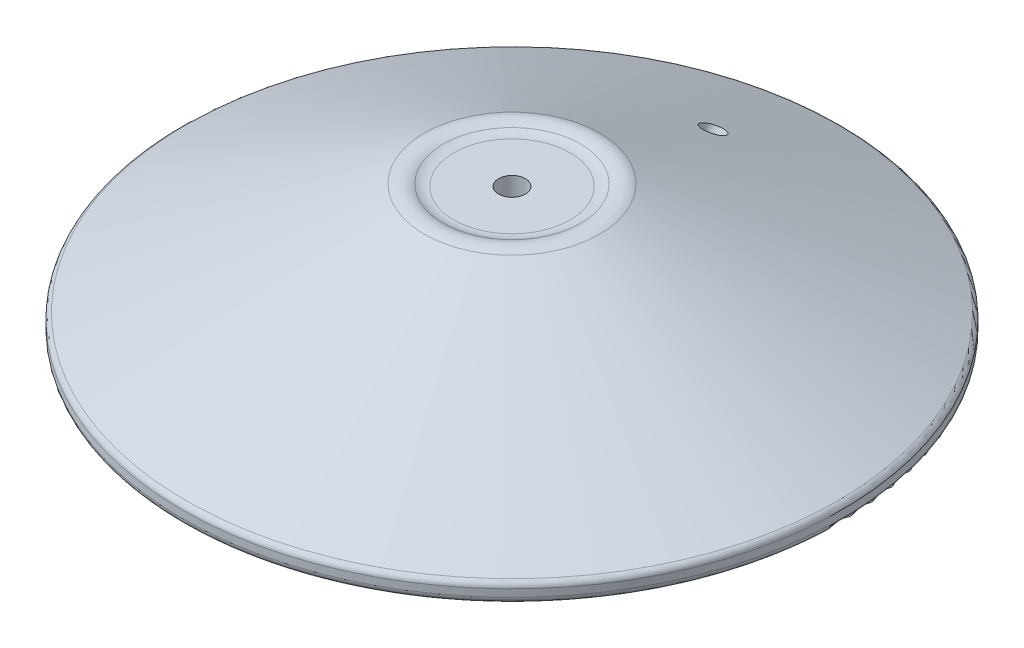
ISO-10303-21;
HEADER;
FILE_DESCRIPTION(('STEP AP214'),'2;1');
FILE_NAME('part.step','',(''),(''),'','','');
FILE_SCHEMA(('AUTOMOTIVE_DESIGN { 1 0 10303 214 1 1 1 1 }'));
ENDSEC;
DATA;
#1=APPLICATION_CONTEXT('core data for automotive mechanical design processes');
#2=APPLICATION_PROTOCOL_DEFINITION('international standard','automotive_design',2000,#1);
#3=PRODUCT_CONTEXT('',#1,'mechanical');
#4=PRODUCT('Part','Part','',(#3));
#5=PRODUCT_RELATED_PRODUCT_CATEGORY('part','',(#4));
#6=PRODUCT_DEFINITION_FORMATION('','',#4);
#7=PRODUCT_DEFINITION_CONTEXT('part definition',#1,'design');
#8=PRODUCT_DEFINITION('design','',#6,#7);
#9=PRODUCT_DEFINITION_SHAPE('','',#8);
#10=(LENGTH_UNIT() NAMED_UNIT(*) SI_UNIT(.MILLI.,.METRE.));
#11=(NAMED_UNIT(*) PLANE_ANGLE_UNIT() SI_UNIT($,.RADIAN.));
#12=(NAMED_UNIT(*) SI_UNIT($,.STERADIAN.) SOLID_ANGLE_UNIT());
#13=UNCERTAINTY_MEASURE_WITH_UNIT(LENGTH_MEASURE(1.E-05),#10,'distance_accuracy_value','');
#14=(GEOMETRIC_REPRESENTATION_CONTEXT(3) GLOBAL_UNCERTAINTY_ASSIGNED_CONTEXT((#13)) GLOBAL_UNIT_ASSIGNED_CONTEXT((#10,
#11,#12)) REPRESENTATION_CONTEXT('',''));
#15=CARTESIAN_POINT('',(0.,0.,0.));
#16=DIRECTION('',(0.,0.,1.));
#17=DIRECTION('',(1.,0.,0.));
#18=AXIS2_PLACEMENT_3D('',#15,#16,#17);
#19=CARTESIAN_POINT('',(0.,0.,0.));
#20=DIRECTION('',(0.,-1.,0.));
#21=DIRECTION('',(0.,0.,-1.));
#22=AXIS2_PLACEMENT_3D('',#19,#20,#21);
#23=CYLINDRICAL_SURFACE('',#22,6.);
#24=CARTESIAN_POINT('',(0.,3.00000000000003,0.));
#25=DIRECTION('',(0.,-1.,0.));
#26=DIRECTION('',(0.,0.,-1.));
#27=AXIS2_PLACEMENT_3D('',#24,#25,#26);
#28=CIRCLE('',#27,6.);
#29=CARTESIAN_POINT('',(0.,3.00000000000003,-6.));
#30=VERTEX_POINT('',#29);
#31=EDGE_CURVE('E49',#30,#30,#28,.T.);
#32=ORIENTED_EDGE('',*,*,#31,.T.);
#33=EDGE_LOOP('',(#32));
#34=FACE_BOUND('',#33,.T.);
#35=CARTESIAN_POINT('',(0.,58.,0.));
#36=DIRECTION('',(0.,-1.,0.));
#37=DIRECTION('',(0.,0.,-1.));
#38=AXIS2_PLACEMENT_3D('',#35,#36,#37);
#39=CIRCLE('',#38,6.);
#40=CARTESIAN_POINT('',(0.,58.,-6.));
#41=VERTEX_POINT('',#40);
#42=EDGE_CURVE('E62',#41,#41,#39,.T.);
#43=ORIENTED_EDGE('',*,*,#42,.F.);
#44=EDGE_LOOP('',(#43));
#45=FACE_BOUND('',#44,.T.);
#46=ADVANCED_FACE('F41',(#34,#45),#23,.F.);
#47=CARTESIAN_POINT('',(6.00000000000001,0.,0.));
#48=DIRECTION('',(0.,-1.,0.));
#49=DIRECTION('',(0.,0.,-1.));
#50=AXIS2_PLACEMENT_3D('',#47,#48,#49);
#51=PLANE('',#50);
#52=CARTESIAN_POINT('',(0.,0.,0.));
#53=DIRECTION('',(0.,-1.,0.));
#54=DIRECTION('',(0.,0.,-1.));
#55=AXIS2_PLACEMENT_3D('',#52,#53,#54);
#56=CIRCLE('',#55,9.00000000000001);
#57=CARTESIAN_POINT('',(0.,0.,-9.00000000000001));
#58=VERTEX_POINT('',#57);
#59=EDGE_CURVE('E11',#58,#58,#56,.F.);
#60=ORIENTED_EDGE('',*,*,#59,.T.);
#61=EDGE_LOOP('',(#60));
#62=FACE_BOUND('',#61,.T.);
#63=CARTESIAN_POINT('',(0.,0.,0.));
#64=DIRECTION('',(0.,-1.,0.));
#65=DIRECTION('',(0.,0.,-1.));
#66=AXIS2_PLACEMENT_3D('',#63,#64,#65);
#67=CIRCLE('',#66,144.5);
#68=CARTESIAN_POINT('',(0.,0.,-144.5));
#69=VERTEX_POINT('',#68);
#70=EDGE_CURVE('E85',#69,#69,#67,.T.);
#71=ORIENTED_EDGE('',*,*,#70,.T.);
#72=EDGE_LOOP('',(#71));
#73=FACE_BOUND('',#72,.T.);
#74=ADVANCED_FACE('F120',(#62,#73),#51,.T.);
#75=CARTESIAN_POINT('',(0.,3.,0.));
#76=DIRECTION('',(0.,-1.,0.));
#77=DIRECTION('',(0.,0.,-1.));
#78=AXIS2_PLACEMENT_3D('',#75,#76,#77);
#79=TOROIDAL_SURFACE('',#78,144.5,3.);
#80=CARTESIAN_POINT('',(0.,3.,0.));
#81=DIRECTION('',(0.,-1.,0.));
#82=DIRECTION('',(0.,0.,-1.));
#83=AXIS2_PLACEMENT_3D('',#80,#81,#82);
#84=CIRCLE('',#83,147.5);
#85=CARTESIAN_POINT('',(0.,3.,-147.5));
#86=VERTEX_POINT('',#85);
#87=EDGE_CURVE('E82',#86,#86,#84,.T.);
#88=ORIENTED_EDGE('',*,*,#87,.T.);
#89=EDGE_LOOP('',(#88));
#90=FACE_BOUND('',#89,.T.);
#91=ORIENTED_EDGE('',*,*,#70,.F.);
#92=EDGE_LOOP('',(#91));
#93=FACE_BOUND('',#92,.T.);
#94=ADVANCED_FACE('F126',(#90,#93),#79,.T.);
#95=CARTESIAN_POINT('',(0.,0.,0.));
#96=DIRECTION('',(0.,-1.,0.));
#97=DIRECTION('',(0.,0.,-1.));
#98=AXIS2_PLACEMENT_3D('',#95,#96,#97);
#99=CYLINDRICAL_SURFACE('',#98,147.5);
#100=CARTESIAN_POINT('',(0.,6.28477999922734,0.));
#101=DIRECTION('',(0.,-1.,0.));
#102=DIRECTION('',(0.,0.,-1.));
#103=AXIS2_PLACEMENT_3D('',#100,#101,#102);
#104=CIRCLE('',#103,147.5);
#105=CARTESIAN_POINT('',(0.,6.28477999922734,-147.5));
#106=VERTEX_POINT('',#105);
#107=EDGE_CURVE('E79',#106,#106,#104,.T.);
#108=ORIENTED_EDGE('',*,*,#107,.T.);
#109=EDGE_LOOP('',(#108));
#110=FACE_BOUND('',#109,.T.);
#111=ORIENTED_EDGE('',*,*,#87,.F.);
#112=EDGE_LOOP('',(#111));
#113=FACE_BOUND('',#112,.T.);
#114=ADVANCED_FACE('F134',(#110,#113),#99,.T.);
#115=CARTESIAN_POINT('',(0.,6.28477999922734,0.));
#116=DIRECTION('',(0.,-1.,0.));
#117=DIRECTION('',(0.,0.,-1.));
#118=AXIS2_PLACEMENT_3D('',#115,#116,#117);
#119=TOROIDAL_SURFACE('',#118,144.5,3.);
#120=CARTESIAN_POINT('',(0.,9.,0.));
#121=DIRECTION('',(0.,-1.,0.));
#122=DIRECTION('',(0.,0.,-1.));
#123=AXIS2_PLACEMENT_3D('',#120,#121,#122);
#124=CIRCLE('',#123,145.775766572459);
#125=CARTESIAN_POINT('',(0.,9.,-145.775766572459));
#126=VERTEX_POINT('',#125);
#127=EDGE_CURVE('E76',#126,#126,#124,.T.);
#128=ORIENTED_EDGE('',*,*,#127,.T.);
#129=EDGE_LOOP('',(#128));
#130=FACE_BOUND('',#129,.T.);
#131=ORIENTED_EDGE('',*,*,#107,.F.);
#132=EDGE_LOOP('',(#131));
#133=FACE_BOUND('',#132,.T.);
#134=ADVANCED_FACE('F116',(#130,#133),#119,.T.);
#135=CARTESIAN_POINT('',(0.,9.,0.));
#136=DIRECTION('',(0.,-1.,0.));
#137=DIRECTION('',(0.,0.,-1.));
#138=AXIS2_PLACEMENT_3D('',#135,#136,#137);
#139=CONICAL_SURFACE('',#138,145.775766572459,1.13155213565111);
#140=CARTESIAN_POINT('',(-3.52035125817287,33.6711500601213,-93.2015812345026));
#141=CARTESIAN_POINT('',(-3.62010665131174,33.711735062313,-93.111374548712));
#142=CARTESIAN_POINT('',(-3.71567892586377,33.7540979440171,-93.0173680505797));
#143=CARTESIAN_POINT('',(-3.89783634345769,33.842131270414,-92.8223865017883));
#144=CARTESIAN_POINT('',(-3.9844191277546,33.8878025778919,-92.7214096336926));
#145=CARTESIAN_POINT('',(-4.14801783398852,33.9821873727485,-92.5131540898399));
#146=CARTESIAN_POINT('',(-4.22502520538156,34.0309035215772,-92.4058699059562));
#147=CARTESIAN_POINT('',(-4.36886420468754,34.1310428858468,-92.1858154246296));
#148=CARTESIAN_POINT('',(-4.43569210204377,34.1824670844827,-92.0730431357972));
#149=CARTESIAN_POINT('',(-4.55861038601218,34.2876229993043,-91.8429605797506));
#150=CARTESIAN_POINT('',(-4.6147096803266,34.3413527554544,-91.7256541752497));
#151=CARTESIAN_POINT('',(-4.7158596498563,34.4508225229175,-91.4872159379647));
#152=CARTESIAN_POINT('',(-4.7609062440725,34.5065632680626,-91.366082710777));
#153=CARTESIAN_POINT('',(-4.83957871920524,34.6196258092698,-91.1209795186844));
#154=CARTESIAN_POINT('',(-4.8732116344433,34.6769466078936,-90.9970113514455));
#155=CARTESIAN_POINT('',(-4.92886606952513,34.7928333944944,-90.7470088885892));
#156=CARTESIAN_POINT('',(-4.95088330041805,34.8513998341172,-90.6209738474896));
#157=CARTESIAN_POINT('',(-4.98312360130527,34.9693278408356,-90.3678397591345));
#158=CARTESIAN_POINT('',(-4.99335177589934,35.0286890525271,-90.2407411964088));
#159=CARTESIAN_POINT('',(-5.00195991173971,35.1478392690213,-89.9862861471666));
#160=CARTESIAN_POINT('',(-5.00033549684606,35.2076284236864,-89.858929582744));
#161=CARTESIAN_POINT('',(-4.98524209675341,35.3271701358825,-89.604954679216));
#162=CARTESIAN_POINT('',(-4.97177703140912,35.3869226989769,-89.4783361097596));
#163=CARTESIAN_POINT('',(-4.93309653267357,35.5060052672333,-89.2266470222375));
#164=CARTESIAN_POINT('',(-4.90787676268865,35.5653351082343,-89.1015770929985));
#165=CARTESIAN_POINT('',(-4.84588099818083,35.6830881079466,-88.8539846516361));
#166=CARTESIAN_POINT('',(-4.80911120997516,35.7415117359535,-88.731460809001));
#167=CARTESIAN_POINT('',(-4.72425951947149,35.8570763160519,-88.4897130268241));
#168=CARTESIAN_POINT('',(-4.67617344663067,35.9142167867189,-88.370490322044));
#169=CARTESIAN_POINT('',(-4.56904952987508,36.0267512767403,-88.1362653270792));
#170=CARTESIAN_POINT('',(-4.51001574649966,36.0821459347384,-88.0212614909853));
#171=CARTESIAN_POINT('',(-4.38141453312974,36.1907982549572,-87.796224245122));
#172=CARTESIAN_POINT('',(-4.31184322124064,36.2440551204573,-87.6861926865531));
#173=CARTESIAN_POINT('',(-4.08804021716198,36.3999751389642,-87.3647877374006));
#174=CARTESIAN_POINT('',(-3.9186207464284,36.498891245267,-87.1618888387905));
#175=CARTESIAN_POINT('',(-3.54438832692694,36.683384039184,-86.7849253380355));
#176=CARTESIAN_POINT('',(-3.33957538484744,36.7689607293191,-86.6108607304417));
#177=CARTESIAN_POINT('',(-2.90022728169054,36.9241643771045,-86.2961789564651));
#178=CARTESIAN_POINT('',(-2.66568539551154,36.9937877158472,-86.1555693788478));
#179=CARTESIAN_POINT('',(-2.17359329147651,37.1147984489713,-85.9117584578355));
#180=CARTESIAN_POINT('',(-1.91604306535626,37.1661858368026,-85.808557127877));
#181=CARTESIAN_POINT('',(-1.38526127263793,37.2490475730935,-85.6423887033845));
#182=CARTESIAN_POINT('',(-1.11203107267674,37.2805236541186,-85.5794181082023));
#183=CARTESIAN_POINT('',(-0.557629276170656,37.3225292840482,-85.4954234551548));
#184=CARTESIAN_POINT('',(-0.276457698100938,37.3330588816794,-85.4743992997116));
#185=CARTESIAN_POINT('',(0.285763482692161,37.3328226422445,-85.4748712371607));
#186=CARTESIAN_POINT('',(0.566813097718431,37.3220626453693,-85.4963556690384));
#187=CARTESIAN_POINT('',(1.12088879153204,37.2796157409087,-85.581234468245));
#188=CARTESIAN_POINT('',(1.3939148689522,37.2479288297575,-85.6446288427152));
#189=CARTESIAN_POINT('',(1.92419222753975,37.1646739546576,-85.8115924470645));
#190=CARTESIAN_POINT('',(2.18144369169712,37.1131062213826,-85.9151612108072));
#191=CARTESIAN_POINT('',(2.67287970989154,36.9917728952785,-86.1596357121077));
#192=CARTESIAN_POINT('',(2.90706422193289,36.922007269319,-86.3005415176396));
#193=CARTESIAN_POINT('',(3.34578630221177,36.7665006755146,-86.6158599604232));
#194=CARTESIAN_POINT('',(3.55031583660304,36.6807553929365,-86.790281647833));
#195=CARTESIAN_POINT('',(3.92385062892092,36.4960107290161,-87.1677894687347));
#196=CARTESIAN_POINT('',(4.09285586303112,36.397011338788,-87.3708756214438));
#197=CARTESIAN_POINT('',(4.39056140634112,36.1888097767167,-87.8000946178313));
#198=CARTESIAN_POINT('',(4.51925736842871,36.0796065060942,-88.0262299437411));
#199=CARTESIAN_POINT('',(4.73266260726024,35.854308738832,-88.4952059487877));
#200=CARTESIAN_POINT('',(4.81737195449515,35.7382142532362,-88.7380466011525));
#201=CARTESIAN_POINT('',(4.94038235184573,35.502585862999,-89.2335446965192));
#202=CARTESIAN_POINT('',(4.97869338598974,35.3830527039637,-89.4862000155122));
#203=CARTESIAN_POINT('',(5.00785024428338,35.1439615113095,-89.9942235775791));
#204=CARTESIAN_POINT('',(4.99869610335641,35.0244034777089,-90.2495918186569));
#205=CARTESIAN_POINT('',(4.93319224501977,34.7886375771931,-90.755722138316));
#206=CARTESIAN_POINT('',(4.87685094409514,34.6724291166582,-91.0064850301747));
#207=CARTESIAN_POINT('',(4.71857461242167,34.4465137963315,-91.4962866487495));
#208=CARTESIAN_POINT('',(4.61663958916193,34.3368069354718,-91.7353253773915));
#209=CARTESIAN_POINT('',(4.37009498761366,34.1268234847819,-92.1948128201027));
#210=CARTESIAN_POINT('',(4.22547979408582,34.0265481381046,-92.4152590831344));
#211=CARTESIAN_POINT('',(3.89753243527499,33.838013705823,-92.8312819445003));
#212=CARTESIAN_POINT('',(3.71420014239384,33.7497546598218,-93.0268584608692));
#213=CARTESIAN_POINT('',(3.41435774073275,33.6281643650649,-93.2971298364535));
#214=CARTESIAN_POINT('',(3.31019387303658,33.5894123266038,-93.3834199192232));
#215=CARTESIAN_POINT('',(3.0942825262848,33.5157311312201,-93.5477250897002));
#216=CARTESIAN_POINT('',(2.98253785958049,33.4808005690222,-93.6257432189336));
#217=CARTESIAN_POINT('',(2.75220951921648,33.4149707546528,-93.7729632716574));
#218=CARTESIAN_POINT('',(2.63362332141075,33.3840730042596,-93.8421619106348));
#219=CARTESIAN_POINT('',(2.39053019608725,33.3265238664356,-93.9711906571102));
#220=CARTESIAN_POINT('',(2.26602547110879,33.2998709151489,-94.0310242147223));
#221=CARTESIAN_POINT('',(2.01189371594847,33.2509557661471,-94.1409349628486));
#222=CARTESIAN_POINT('',(1.88226478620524,33.2286952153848,-94.1910084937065));
#223=CARTESIAN_POINT('',(1.61889854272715,33.1887226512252,-94.2809893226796));
#224=CARTESIAN_POINT('',(1.4851627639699,33.1710089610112,-94.3209003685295));
#225=CARTESIAN_POINT('',(1.21444332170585,33.1402239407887,-94.390299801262));
#226=CARTESIAN_POINT('',(1.07745860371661,33.1271541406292,-94.4197847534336));
#227=CARTESIAN_POINT('',(0.801309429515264,33.1057496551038,-94.4680889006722));
#228=CARTESIAN_POINT('',(0.662145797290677,33.0974132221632,-94.4869120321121));
#229=CARTESIAN_POINT('',(0.382572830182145,33.0855190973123,-94.5137721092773));
#230=CARTESIAN_POINT('',(0.242163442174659,33.0819616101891,-94.521808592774));
#231=CARTESIAN_POINT('',(-0.0388445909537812,33.0796483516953,-94.5270340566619));
#232=CARTESIAN_POINT('',(-0.179443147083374,33.0808908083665,-94.5242270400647));
#233=CARTESIAN_POINT('',(-0.459968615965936,33.0881680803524,-94.5077899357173));
#234=CARTESIAN_POINT('',(-0.599895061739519,33.0942058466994,-94.494153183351));
#235=CARTESIAN_POINT('',(-0.877941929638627,33.111037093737,-94.4561553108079));
#236=CARTESIAN_POINT('',(-1.01606299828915,33.1218288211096,-94.4317981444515));
#237=CARTESIAN_POINT('',(-1.28967208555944,33.1481109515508,-94.3725163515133));
#238=CARTESIAN_POINT('',(-1.42515806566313,33.1636048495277,-94.3375838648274));
#239=CARTESIAN_POINT('',(-1.69237696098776,33.199185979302,-94.2574287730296));
#240=CARTESIAN_POINT('',(-1.82411122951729,33.2192715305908,-94.2122099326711));
#241=CARTESIAN_POINT('',(-2.08282938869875,33.2638956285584,-94.1118483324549));
#242=CARTESIAN_POINT('',(-2.20981737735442,33.2884302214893,-94.0567143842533));
#243=CARTESIAN_POINT('',(-2.45822307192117,33.3418019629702,-93.9369199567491));
#244=CARTESIAN_POINT('',(-2.57964222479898,33.3706379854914,-93.8722619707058));
#245=CARTESIAN_POINT('',(-2.84603235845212,33.4402673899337,-93.7163462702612));
#246=CARTESIAN_POINT('',(-2.98918995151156,33.4822402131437,-93.6224975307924));
#247=CARTESIAN_POINT('',(-3.26387007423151,33.5722621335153,-93.4216137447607));
#248=CARTESIAN_POINT('',(-3.39539260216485,33.620311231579,-93.3145786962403));
#249=CARTESIAN_POINT('',(-3.52035125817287,33.6711500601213,-93.2015812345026));
#250=B_SPLINE_CURVE_WITH_KNOTS('',3,(#140,#141,#142,#143,#144,#145,#146,#147,#148,#149,#150,
#151,#152,#153,#154,#155,#156,#157,#158,#159,#160,#161,#162,#163,#164,#165,#166,#167,#168,#169,
#170,#171,#172,#173,#174,#175,#176,#177,#178,#179,#180,#181,#182,#183,#184,#185,#186,#187,#188,
#189,#190,#191,#192,#193,#194,#195,#196,#197,#198,#199,#200,#201,#202,#203,#204,#205,#206,#207,
#208,#209,#210,#211,#212,#213,#214,#215,#216,#217,#218,#219,#220,#221,#222,#223,#224,#225,#226,
#227,#228,#229,#230,#231,#232,#233,#234,#235,#236,#237,#238,#239,#240,#241,#242,#243,#244,#245,
#246,#247,#248,#249),.UNSPECIFIED.,.T.,.F.,(4,2,2,2,2,2,2,2,2,2,2,2,2,2,2,2,2,2,2,2,2,2,2,2,2,2,
2,2,2,2,2,2,2,2,2,2,2,2,2,2,2,2,2,2,2,2,2,2,2,2,2,2,2,2,4),(0.,0.421295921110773,
0.842702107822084,1.26448193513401,1.68641596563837,2.10799813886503,2.5297357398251,
2.95121294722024,3.37284567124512,3.79429576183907,4.21590146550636,4.63736764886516,
5.05898944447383,5.48038507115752,5.90193624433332,6.32333137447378,6.7448821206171,
7.58721807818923,8.4295538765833,9.27208056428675,10.1146075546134,10.9570612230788,
11.799512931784,12.6417335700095,13.483954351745,14.3261653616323,15.1683779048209,
16.0108181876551,16.853259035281,17.6957907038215,18.5383210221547,19.3806700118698,
20.2230183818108,21.0652165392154,21.9074145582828,22.7497234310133,23.5920350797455,
24.0137390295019,24.4352873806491,24.856992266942,25.2785414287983,25.7002483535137,
26.1217995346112,26.5434894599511,26.9650235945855,27.3865757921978,27.8079723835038,
28.2296285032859,28.65112924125,29.0729440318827,29.4946046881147,29.9158924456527,
30.3370701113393,30.8648066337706,31.3925432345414),.UNSPECIFIED.);
#251=CARTESIAN_POINT('',(-3.52035125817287,33.6711500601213,-93.2015812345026));
#252=VERTEX_POINT('',#251);
#253=EDGE_CURVE('E88',#252,#252,#250,.T.);
#254=ORIENTED_EDGE('',*,*,#253,.F.);
#255=EDGE_LOOP('',(#254));
#256=FACE_BOUND('',#255,.T.);
#257=CARTESIAN_POINT('',(0.,59.0507333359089,0.));
#258=DIRECTION('',(0.,-1.,0.));
#259=DIRECTION('',(0.,0.,-1.));
#260=AXIS2_PLACEMENT_3D('',#257,#258,#259);
#261=CIRCLE('',#260,39.2525552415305);
#262=CARTESIAN_POINT('',(0.,59.0507333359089,-39.2525552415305));
#263=VERTEX_POINT('',#262);
#264=EDGE_CURVE('E73',#263,#263,#261,.T.);
#265=ORIENTED_EDGE('',*,*,#264,.T.);
#266=EDGE_LOOP('',(#265));
#267=FACE_BOUND('',#266,.T.);
#268=ORIENTED_EDGE('',*,*,#127,.F.);
#269=EDGE_LOOP('',(#268));
#270=FACE_BOUND('',#269,.T.);
#271=ADVANCED_FACE('F95',(#256,#267,#270),#139,.T.);
#272=CARTESIAN_POINT('',(0.,50.,0.));
#273=DIRECTION('',(0.,-1.,0.));
#274=DIRECTION('',(0.,0.,-1.));
#275=AXIS2_PLACEMENT_3D('',#272,#273,#274);
#276=TOROIDAL_SURFACE('',#275,35.,10.);
#277=CARTESIAN_POINT('',(0.,59.0507333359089,0.));
#278=DIRECTION('',(0.,-1.,0.));
#279=DIRECTION('',(0.,0.,-1.));
#280=AXIS2_PLACEMENT_3D('',#277,#278,#279);
#281=CIRCLE('',#280,30.7474447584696);
#282=CARTESIAN_POINT('',(0.,59.0507333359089,-30.7474447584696));
#283=VERTEX_POINT('',#282);
#284=EDGE_CURVE('E70',#283,#283,#281,.T.);
#285=ORIENTED_EDGE('',*,*,#284,.T.);
#286=EDGE_LOOP('',(#285));
#287=FACE_BOUND('',#286,.T.);
#288=ORIENTED_EDGE('',*,*,#264,.F.);
#289=EDGE_LOOP('',(#288));
#290=FACE_BOUND('',#289,.T.);
#291=ADVANCED_FACE('F108',(#287,#290),#276,.T.);
#292=CARTESIAN_POINT('',(0.,69.0688953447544,0.));
#293=DIRECTION('',(0.,-1.,0.));
#294=DIRECTION('',(0.,0.,-1.));
#295=AXIS2_PLACEMENT_3D('',#292,#293,#294);
#296=TOROIDAL_SURFACE('',#295,26.0403358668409,11.0688953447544);
#297=CARTESIAN_POINT('',(0.,58.,0.));
#298=DIRECTION('',(0.,-1.,0.));
#299=DIRECTION('',(0.,0.,-1.));
#300=AXIS2_PLACEMENT_3D('',#297,#298,#299);
#301=CIRCLE('',#300,26.0403358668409);
#302=CARTESIAN_POINT('',(0.,58.,-26.0403358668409));
#303=VERTEX_POINT('',#302);
#304=EDGE_CURVE('E65',#303,#303,#301,.T.);
#305=ORIENTED_EDGE('',*,*,#304,.T.);
#306=EDGE_LOOP('',(#305));
#307=FACE_BOUND('',#306,.T.);
#308=ORIENTED_EDGE('',*,*,#284,.F.);
#309=EDGE_LOOP('',(#308));
#310=FACE_BOUND('',#309,.T.);
#311=ADVANCED_FACE('F105',(#307,#310),#296,.F.);
#312=CARTESIAN_POINT('',(26.0403358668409,58.,0.));
#313=DIRECTION('',(0.,1.,0.));
#314=DIRECTION('',(0.,0.,1.));
#315=AXIS2_PLACEMENT_3D('',#312,#313,#314);
#316=PLANE('',#315);
#317=ORIENTED_EDGE('',*,*,#42,.T.);
#318=EDGE_LOOP('',(#317));
#319=FACE_BOUND('',#318,.T.);
#320=ORIENTED_EDGE('',*,*,#304,.F.);
#321=EDGE_LOOP('',(#320));
#322=FACE_BOUND('',#321,.T.);
#323=ADVANCED_FACE('F56',(#319,#322),#316,.T.);
#324=CARTESIAN_POINT('',(0.,26.1559307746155,-85.7474447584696));
#325=DIRECTION('',(0.,0.905073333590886,-0.425255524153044));
#326=DIRECTION('',(0.,0.425255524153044,0.905073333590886));
#327=AXIS2_PLACEMENT_3D('',#324,#325,#326);
#328=CONICAL_SURFACE('',#327,5.,1.02974425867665);
#329=CARTESIAN_POINT('',(0.,23.4368161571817,-84.4698482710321));
#330=VERTEX_POINT('',#329);
#331=VERTEX_LOOP('',#330);
#332=FACE_BOUND('',#331,.T.);
#333=CARTESIAN_POINT('',(0.,26.1559307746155,-85.7474447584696));
#334=DIRECTION('',(0.,0.905073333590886,-0.425255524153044));
#335=DIRECTION('',(0.,0.425255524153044,0.905073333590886));
#336=AXIS2_PLACEMENT_3D('',#333,#334,#335);
#337=CIRCLE('',#336,5.);
#338=CARTESIAN_POINT('',(0.,28.2822083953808,-81.2220780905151));
#339=VERTEX_POINT('',#338);
#340=EDGE_CURVE('E60',#339,#339,#337,.T.);
#341=ORIENTED_EDGE('',*,*,#340,.T.);
#342=EDGE_LOOP('',(#341));
#343=FACE_BOUND('',#342,.T.);
#344=ADVANCED_FACE('F52',(#332,#343),#328,.F.);
#345=CARTESIAN_POINT('',(0.,35.2066641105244,-90.));
#346=DIRECTION('',(0.,0.905073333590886,-0.425255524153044));
#347=DIRECTION('',(0.,0.425255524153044,0.905073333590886));
#348=AXIS2_PLACEMENT_3D('',#345,#346,#347);
#349=CYLINDRICAL_SURFACE('',#348,4.99999999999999);
#350=ORIENTED_EDGE('',*,*,#253,.T.);
#351=EDGE_LOOP('',(#350));
#352=FACE_BOUND('',#351,.T.);
#353=ORIENTED_EDGE('',*,*,#340,.F.);
#354=EDGE_LOOP('',(#353));
#355=FACE_BOUND('',#354,.T.);
#356=ADVANCED_FACE('F55',(#352,#355),#349,.F.);
#357=CARTESIAN_POINT('',(0.,3.00000000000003,0.));
#358=DIRECTION('',(0.,-1.,0.));
#359=DIRECTION('',(0.,0.,-1.));
#360=AXIS2_PLACEMENT_3D('',#357,#358,#359);
#361=CONICAL_SURFACE('',#360,6.,0.785398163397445);
#362=ORIENTED_EDGE('',*,*,#59,.F.);
#363=EDGE_LOOP('',(#362));
#364=FACE_BOUND('',#363,.T.);
#365=ORIENTED_EDGE('',*,*,#31,.F.);
#366=EDGE_LOOP('',(#365));
#367=FACE_BOUND('',#366,.T.);
#368=ADVANCED_FACE('F44',(#364,#367),#361,.F.);
#369=CLOSED_SHELL('',(#46,#74,#94,#114,#134,#271,#291,#311,#323,#344,#356,#368));
#370=MANIFOLD_SOLID_BREP('B2',#369);
#371=ADVANCED_BREP_SHAPE_REPRESENTATION('',(#18,#370),#14);
#372=SHAPE_DEFINITION_REPRESENTATION(#9,#371);
ENDSEC;
END-ISO-10303-21;
